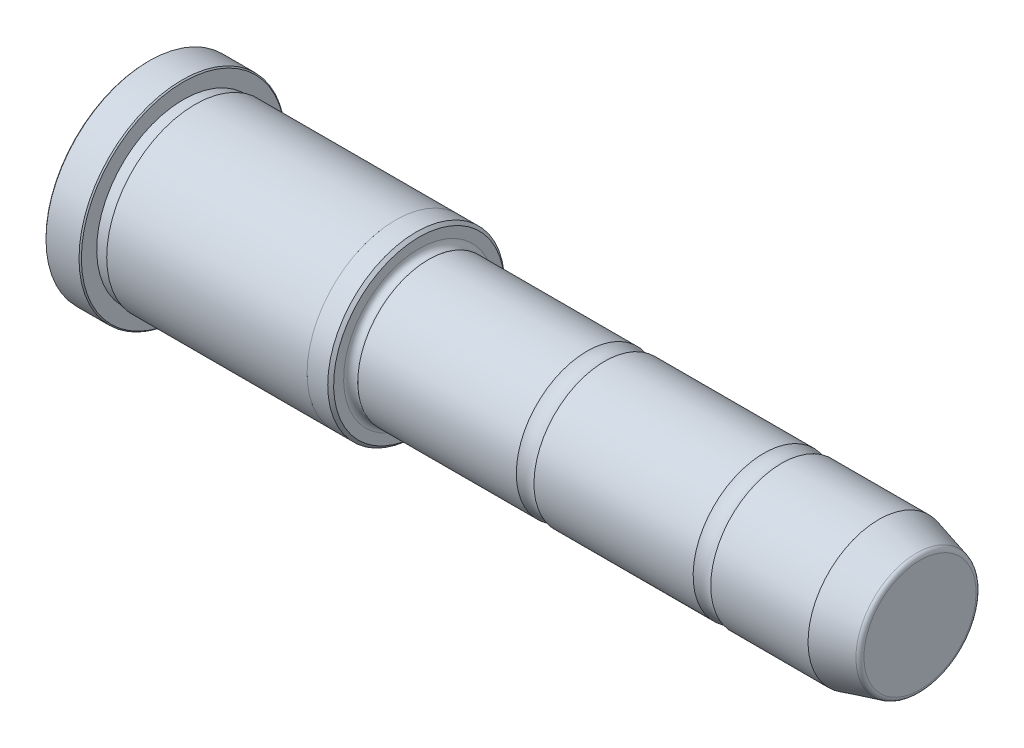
ISO-10303-21;
HEADER;
FILE_DESCRIPTION(('STEP AP214'),'2;1');
FILE_NAME('part.step','',(''),(''),'','','');
FILE_SCHEMA(('AUTOMOTIVE_DESIGN { 1 0 10303 214 1 1 1 1 }'));
ENDSEC;
DATA;
#1=APPLICATION_CONTEXT('core data for automotive mechanical design processes');
#2=APPLICATION_PROTOCOL_DEFINITION('international standard','automotive_design',2000,#1);
#3=PRODUCT_CONTEXT('',#1,'mechanical');
#4=PRODUCT('Part','Part','',(#3));
#5=PRODUCT_RELATED_PRODUCT_CATEGORY('part','',(#4));
#6=PRODUCT_DEFINITION_FORMATION('','',#4);
#7=PRODUCT_DEFINITION_CONTEXT('part definition',#1,'design');
#8=PRODUCT_DEFINITION('design','',#6,#7);
#9=PRODUCT_DEFINITION_SHAPE('','',#8);
#10=(LENGTH_UNIT() NAMED_UNIT(*) SI_UNIT(.MILLI.,.METRE.));
#11=(NAMED_UNIT(*) PLANE_ANGLE_UNIT() SI_UNIT($,.RADIAN.));
#12=(NAMED_UNIT(*) SI_UNIT($,.STERADIAN.) SOLID_ANGLE_UNIT());
#13=UNCERTAINTY_MEASURE_WITH_UNIT(LENGTH_MEASURE(1.E-05),#10,'distance_accuracy_value','');
#14=(GEOMETRIC_REPRESENTATION_CONTEXT(3) GLOBAL_UNCERTAINTY_ASSIGNED_CONTEXT((#13)) GLOBAL_UNIT_ASSIGNED_CONTEXT((#10,
#11,#12)) REPRESENTATION_CONTEXT('',''));
#15=CARTESIAN_POINT('',(0.,0.,0.));
#16=DIRECTION('',(0.,0.,1.));
#17=DIRECTION('',(1.,0.,0.));
#18=AXIS2_PLACEMENT_3D('',#15,#16,#17);
#19=CARTESIAN_POINT('',(85.,0.,0.));
#20=DIRECTION('',(1.,0.,0.));
#21=DIRECTION('',(0.,1.,0.));
#22=AXIS2_PLACEMENT_3D('',#19,#20,#21);
#23=CYLINDRICAL_SURFACE('',#22,12.);
#24=CARTESIAN_POINT('',(1.6,0.,0.));
#25=DIRECTION('',(1.,0.,0.));
#26=DIRECTION('',(0.,1.,0.));
#27=AXIS2_PLACEMENT_3D('',#24,#25,#26);
#28=CIRCLE('',#27,12.);
#29=CARTESIAN_POINT('',(1.6,12.,0.));
#30=VERTEX_POINT('',#29);
#31=EDGE_CURVE('E63',#30,#30,#28,.T.);
#32=ORIENTED_EDGE('',*,*,#31,.T.);
#33=EDGE_LOOP('',(#32));
#34=FACE_BOUND('',#33,.T.);
#35=CARTESIAN_POINT('',(28.5033370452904,0.,0.));
#36=DIRECTION('',(-1.,0.,0.));
#37=DIRECTION('',(0.,-1.,0.));
#38=AXIS2_PLACEMENT_3D('',#35,#36,#37);
#39=CIRCLE('',#38,12.);
#40=CARTESIAN_POINT('',(28.5033370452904,-12.,0.));
#41=VERTEX_POINT('',#40);
#42=EDGE_CURVE('E93',#41,#41,#39,.T.);
#43=ORIENTED_EDGE('',*,*,#42,.T.);
#44=EDGE_LOOP('',(#43));
#45=FACE_BOUND('',#44,.T.);
#46=ADVANCED_FACE('F28',(#34,#45),#23,.T.);
#47=CARTESIAN_POINT('',(1.,0.,0.));
#48=DIRECTION('',(1.,0.,0.));
#49=DIRECTION('',(0.,1.,0.));
#50=AXIS2_PLACEMENT_3D('',#47,#48,#49);
#51=TOROIDAL_SURFACE('',#50,12.8,1.);
#52=CARTESIAN_POINT('',(0.,0.,0.));
#53=DIRECTION('',(1.,0.,0.));
#54=DIRECTION('',(0.,1.,0.));
#55=AXIS2_PLACEMENT_3D('',#52,#53,#54);
#56=CIRCLE('',#55,12.8);
#57=CARTESIAN_POINT('',(0.,12.8,0.));
#58=VERTEX_POINT('',#57);
#59=EDGE_CURVE('E66',#58,#58,#56,.T.);
#60=ORIENTED_EDGE('',*,*,#59,.T.);
#61=EDGE_LOOP('',(#60));
#62=FACE_BOUND('',#61,.T.);
#63=ORIENTED_EDGE('',*,*,#31,.F.);
#64=EDGE_LOOP('',(#63));
#65=FACE_BOUND('',#64,.T.);
#66=ADVANCED_FACE('F116',(#62,#65),#51,.F.);
#67=CARTESIAN_POINT('',(0.,12.8,0.));
#68=DIRECTION('',(1.,0.,0.));
#69=DIRECTION('',(0.,1.,0.));
#70=AXIS2_PLACEMENT_3D('',#67,#68,#69);
#71=PLANE('',#70);
#72=CARTESIAN_POINT('',(0.,0.,0.));
#73=DIRECTION('',(1.,0.,0.));
#74=DIRECTION('',(0.,1.,0.));
#75=AXIS2_PLACEMENT_3D('',#72,#73,#74);
#76=CIRCLE('',#75,14.5);
#77=CARTESIAN_POINT('',(0.,14.5,0.));
#78=VERTEX_POINT('',#77);
#79=EDGE_CURVE('E35',#78,#78,#76,.T.);
#80=ORIENTED_EDGE('',*,*,#79,.T.);
#81=EDGE_LOOP('',(#80));
#82=FACE_BOUND('',#81,.T.);
#83=ORIENTED_EDGE('',*,*,#59,.F.);
#84=EDGE_LOOP('',(#83));
#85=FACE_BOUND('',#84,.T.);
#86=ADVANCED_FACE('F124',(#82,#85),#71,.T.);
#87=CARTESIAN_POINT('',(85.,0.,0.));
#88=DIRECTION('',(1.,0.,0.));
#89=DIRECTION('',(0.,1.,0.));
#90=AXIS2_PLACEMENT_3D('',#87,#88,#89);
#91=CYLINDRICAL_SURFACE('',#90,15.);
#92=CARTESIAN_POINT('',(-0.499999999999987,0.,0.));
#93=DIRECTION('',(1.,0.,0.));
#94=DIRECTION('',(0.,1.,0.));
#95=AXIS2_PLACEMENT_3D('',#92,#93,#94);
#96=CIRCLE('',#95,15.);
#97=CARTESIAN_POINT('',(-0.499999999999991,15.,0.));
#98=VERTEX_POINT('',#97);
#99=EDGE_CURVE('E10',#98,#98,#96,.F.);
#100=ORIENTED_EDGE('',*,*,#99,.T.);
#101=EDGE_LOOP('',(#100));
#102=FACE_BOUND('',#101,.T.);
#103=CARTESIAN_POINT('',(-4.,0.,0.));
#104=DIRECTION('',(1.,0.,0.));
#105=DIRECTION('',(0.,1.,0.));
#106=AXIS2_PLACEMENT_3D('',#103,#104,#105);
#107=CIRCLE('',#106,15.);
#108=CARTESIAN_POINT('',(-4.00000000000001,15.,0.));
#109=VERTEX_POINT('',#108);
#110=EDGE_CURVE('E69',#109,#109,#107,.T.);
#111=ORIENTED_EDGE('',*,*,#110,.T.);
#112=EDGE_LOOP('',(#111));
#113=FACE_BOUND('',#112,.T.);
#114=ADVANCED_FACE('F195',(#102,#113),#91,.T.);
#115=CARTESIAN_POINT('',(-4.,15.001,0.));
#116=DIRECTION('',(1.,0.,0.));
#117=DIRECTION('',(0.,1.,0.));
#118=AXIS2_PLACEMENT_3D('',#115,#116,#117);
#119=PLANE('',#118);
#120=CARTESIAN_POINT('',(-4.,0.,0.));
#121=DIRECTION('',(1.,0.,0.));
#122=DIRECTION('',(0.,1.,0.));
#123=AXIS2_PLACEMENT_3D('',#120,#121,#122);
#124=CIRCLE('',#123,15.001);
#125=CARTESIAN_POINT('',(-4.00000000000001,15.001,0.));
#126=VERTEX_POINT('',#125);
#127=EDGE_CURVE('E72',#126,#126,#124,.T.);
#128=ORIENTED_EDGE('',*,*,#127,.T.);
#129=EDGE_LOOP('',(#128));
#130=FACE_BOUND('',#129,.T.);
#131=ORIENTED_EDGE('',*,*,#110,.F.);
#132=EDGE_LOOP('',(#131));
#133=FACE_BOUND('',#132,.T.);
#134=ADVANCED_FACE('F189',(#130,#133),#119,.T.);
#135=CARTESIAN_POINT('',(85.,0.,0.));
#136=DIRECTION('',(1.,0.,0.));
#137=DIRECTION('',(0.,1.,0.));
#138=AXIS2_PLACEMENT_3D('',#135,#136,#137);
#139=CYLINDRICAL_SURFACE('',#138,15.001);
#140=CARTESIAN_POINT('',(-38.,0.,0.));
#141=DIRECTION('',(1.,0.,0.));
#142=DIRECTION('',(0.,1.,0.));
#143=AXIS2_PLACEMENT_3D('',#140,#141,#142);
#144=CIRCLE('',#143,15.001);
#145=CARTESIAN_POINT('',(-38.,15.001,0.));
#146=VERTEX_POINT('',#145);
#147=EDGE_CURVE('E75',#146,#146,#144,.T.);
#148=ORIENTED_EDGE('',*,*,#147,.T.);
#149=EDGE_LOOP('',(#148));
#150=FACE_BOUND('',#149,.T.);
#151=ORIENTED_EDGE('',*,*,#127,.F.);
#152=EDGE_LOOP('',(#151));
#153=FACE_BOUND('',#152,.T.);
#154=ADVANCED_FACE('F183',(#150,#153),#139,.T.);
#155=CARTESIAN_POINT('',(-38.,15.001,0.));
#156=DIRECTION('',(-1.,0.,0.));
#157=DIRECTION('',(0.,-1.,0.));
#158=AXIS2_PLACEMENT_3D('',#155,#156,#157);
#159=PLANE('',#158);
#160=CARTESIAN_POINT('',(-38.,0.,0.));
#161=DIRECTION('',(1.,0.,0.));
#162=DIRECTION('',(0.,1.,0.));
#163=AXIS2_PLACEMENT_3D('',#160,#161,#162);
#164=CIRCLE('',#163,14.7);
#165=CARTESIAN_POINT('',(-38.,14.7,0.));
#166=VERTEX_POINT('',#165);
#167=EDGE_CURVE('E78',#166,#166,#164,.T.);
#168=ORIENTED_EDGE('',*,*,#167,.T.);
#169=EDGE_LOOP('',(#168));
#170=FACE_BOUND('',#169,.T.);
#171=ORIENTED_EDGE('',*,*,#147,.F.);
#172=EDGE_LOOP('',(#171));
#173=FACE_BOUND('',#172,.T.);
#174=ADVANCED_FACE('F177',(#170,#173),#159,.T.);
#175=CARTESIAN_POINT('',(85.,0.,0.));
#176=DIRECTION('',(1.,0.,0.));
#177=DIRECTION('',(0.,1.,0.));
#178=AXIS2_PLACEMENT_3D('',#175,#176,#177);
#179=CYLINDRICAL_SURFACE('',#178,14.7);
#180=CARTESIAN_POINT('',(-40.,0.,0.));
#181=DIRECTION('',(1.,0.,0.));
#182=DIRECTION('',(0.,1.,0.));
#183=AXIS2_PLACEMENT_3D('',#180,#181,#182);
#184=CIRCLE('',#183,14.7);
#185=CARTESIAN_POINT('',(-40.,14.7,0.));
#186=VERTEX_POINT('',#185);
#187=EDGE_CURVE('E81',#186,#186,#184,.T.);
#188=ORIENTED_EDGE('',*,*,#187,.T.);
#189=EDGE_LOOP('',(#188));
#190=FACE_BOUND('',#189,.T.);
#191=ORIENTED_EDGE('',*,*,#167,.F.);
#192=EDGE_LOOP('',(#191));
#193=FACE_BOUND('',#192,.T.);
#194=ADVANCED_FACE('F171',(#190,#193),#179,.T.);
#195=CARTESIAN_POINT('',(-40.,14.7,0.));
#196=DIRECTION('',(1.,0.,0.));
#197=DIRECTION('',(0.,1.,0.));
#198=AXIS2_PLACEMENT_3D('',#195,#196,#197);
#199=PLANE('',#198);
#200=CARTESIAN_POINT('',(-40.,0.,0.));
#201=DIRECTION('',(1.,0.,0.));
#202=DIRECTION('',(0.,1.,0.));
#203=AXIS2_PLACEMENT_3D('',#200,#201,#202);
#204=CIRCLE('',#203,17.3);
#205=CARTESIAN_POINT('',(-40.,17.3,0.));
#206=VERTEX_POINT('',#205);
#207=EDGE_CURVE('E39',#206,#206,#204,.T.);
#208=ORIENTED_EDGE('',*,*,#207,.T.);
#209=EDGE_LOOP('',(#208));
#210=FACE_BOUND('',#209,.T.);
#211=ORIENTED_EDGE('',*,*,#187,.F.);
#212=EDGE_LOOP('',(#211));
#213=FACE_BOUND('',#212,.T.);
#214=ADVANCED_FACE('F168',(#210,#213),#199,.T.);
#215=CARTESIAN_POINT('',(85.,0.,0.));
#216=DIRECTION('',(1.,0.,0.));
#217=DIRECTION('',(0.,1.,0.));
#218=AXIS2_PLACEMENT_3D('',#215,#216,#217);
#219=CYLINDRICAL_SURFACE('',#218,17.5);
#220=CARTESIAN_POINT('',(-45.8,0.,0.));
#221=DIRECTION('',(-1.,0.,0.));
#222=DIRECTION('',(0.,-1.,0.));
#223=AXIS2_PLACEMENT_3D('',#220,#221,#222);
#224=CIRCLE('',#223,17.5);
#225=CARTESIAN_POINT('',(-45.8,17.5,0.));
#226=VERTEX_POINT('',#225);
#227=EDGE_CURVE('E48',#226,#226,#224,.F.);
#228=ORIENTED_EDGE('',*,*,#227,.T.);
#229=EDGE_LOOP('',(#228));
#230=FACE_BOUND('',#229,.T.);
#231=CARTESIAN_POINT('',(-40.2,0.,0.));
#232=DIRECTION('',(1.,0.,0.));
#233=DIRECTION('',(0.,1.,0.));
#234=AXIS2_PLACEMENT_3D('',#231,#232,#233);
#235=CIRCLE('',#234,17.5);
#236=CARTESIAN_POINT('',(-40.2,17.5,0.));
#237=VERTEX_POINT('',#236);
#238=EDGE_CURVE('E51',#237,#237,#235,.F.);
#239=ORIENTED_EDGE('',*,*,#238,.T.);
#240=EDGE_LOOP('',(#239));
#241=FACE_BOUND('',#240,.T.);
#242=ADVANCED_FACE('F111',(#230,#241),#219,.T.);
#243=CARTESIAN_POINT('',(-46.,17.5,0.));
#244=DIRECTION('',(-1.,0.,0.));
#245=DIRECTION('',(0.,-1.,0.));
#246=AXIS2_PLACEMENT_3D('',#243,#244,#245);
#247=PLANE('',#246);
#248=CARTESIAN_POINT('',(-46.,0.,0.));
#249=DIRECTION('',(-1.,0.,0.));
#250=DIRECTION('',(0.,-1.,0.));
#251=AXIS2_PLACEMENT_3D('',#248,#249,#250);
#252=CIRCLE('',#251,17.3);
#253=CARTESIAN_POINT('',(-46.,17.3,0.));
#254=VERTEX_POINT('',#253);
#255=EDGE_CURVE('E43',#254,#254,#252,.T.);
#256=ORIENTED_EDGE('',*,*,#255,.T.);
#257=EDGE_LOOP('',(#256));
#258=FACE_BOUND('',#257,.T.);
#259=ADVANCED_FACE('F101',(#258),#247,.T.);
#260=CARTESIAN_POINT('',(30.,0.,0.));
#261=DIRECTION('',(-1.,0.,0.));
#262=DIRECTION('',(0.,-1.,0.));
#263=AXIS2_PLACEMENT_3D('',#260,#261,#262);
#264=TOROIDAL_SURFACE('',#263,14.6,3.);
#265=CARTESIAN_POINT('',(31.4966629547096,0.,0.));
#266=DIRECTION('',(-1.,0.,0.));
#267=DIRECTION('',(0.,-1.,0.));
#268=AXIS2_PLACEMENT_3D('',#265,#266,#267);
#269=CIRCLE('',#268,12.);
#270=CARTESIAN_POINT('',(31.4966629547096,-12.,0.));
#271=VERTEX_POINT('',#270);
#272=EDGE_CURVE('E90',#271,#271,#269,.T.);
#273=ORIENTED_EDGE('',*,*,#272,.T.);
#274=EDGE_LOOP('',(#273));
#275=FACE_BOUND('',#274,.T.);
#276=ORIENTED_EDGE('',*,*,#42,.F.);
#277=EDGE_LOOP('',(#276));
#278=FACE_BOUND('',#277,.T.);
#279=ADVANCED_FACE('F98',(#275,#278),#264,.F.);
#280=CARTESIAN_POINT('',(85.,10.1243556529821,0.));
#281=DIRECTION('',(1.,0.,0.));
#282=DIRECTION('',(0.,1.,0.));
#283=AXIS2_PLACEMENT_3D('',#280,#281,#282);
#284=PLANE('',#283);
#285=CARTESIAN_POINT('',(85.,0.,0.));
#286=DIRECTION('',(1.,0.,0.));
#287=DIRECTION('',(0.,1.,0.));
#288=AXIS2_PLACEMENT_3D('',#285,#286,#287);
#289=CIRCLE('',#288,9.51049406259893);
#290=CARTESIAN_POINT('',(85.,9.51049406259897,0.));
#291=VERTEX_POINT('',#290);
#292=EDGE_CURVE('E57',#291,#291,#289,.T.);
#293=ORIENTED_EDGE('',*,*,#292,.T.);
#294=EDGE_LOOP('',(#293));
#295=FACE_BOUND('',#294,.T.);
#296=ADVANCED_FACE('F100',(#295),#284,.T.);
#297=CARTESIAN_POINT('',(85.,0.,0.));
#298=DIRECTION('',(-1.,0.,0.));
#299=DIRECTION('',(0.,-1.,0.));
#300=AXIS2_PLACEMENT_3D('',#297,#298,#299);
#301=CONICAL_SURFACE('',#300,10.1243556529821,0.26179938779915);
#302=CARTESIAN_POINT('',(84.407055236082,0.,0.));
#303=DIRECTION('',(1.,0.,0.));
#304=DIRECTION('',(0.,1.,0.));
#305=AXIS2_PLACEMENT_3D('',#302,#303,#304);
#306=CIRCLE('',#305,10.2832347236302);
#307=CARTESIAN_POINT('',(84.407055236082,10.2832347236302,0.));
#308=VERTEX_POINT('',#307);
#309=EDGE_CURVE('E54',#308,#308,#306,.F.);
#310=ORIENTED_EDGE('',*,*,#309,.T.);
#311=EDGE_LOOP('',(#310));
#312=FACE_BOUND('',#311,.T.);
#313=CARTESIAN_POINT('',(78.,0.,0.));
#314=DIRECTION('',(1.,0.,0.));
#315=DIRECTION('',(0.,1.,0.));
#316=AXIS2_PLACEMENT_3D('',#313,#314,#315);
#317=CIRCLE('',#316,12.);
#318=CARTESIAN_POINT('',(78.,12.,0.));
#319=VERTEX_POINT('',#318);
#320=EDGE_CURVE('E60',#319,#319,#317,.T.);
#321=ORIENTED_EDGE('',*,*,#320,.T.);
#322=EDGE_LOOP('',(#321));
#323=FACE_BOUND('',#322,.T.);
#324=ADVANCED_FACE('F108',(#312,#323),#301,.T.);
#325=ORIENTED_EDGE('',*,*,#320,.F.);
#326=EDGE_LOOP('',(#325));
#327=FACE_BOUND('',#326,.T.);
#328=CARTESIAN_POINT('',(61.4966629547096,0.,0.));
#329=DIRECTION('',(-1.,0.,0.));
#330=DIRECTION('',(0.,-1.,0.));
#331=AXIS2_PLACEMENT_3D('',#328,#329,#330);
#332=CIRCLE('',#331,12.);
#333=CARTESIAN_POINT('',(61.4966629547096,-12.,0.));
#334=VERTEX_POINT('',#333);
#335=EDGE_CURVE('E84',#334,#334,#332,.T.);
#336=ORIENTED_EDGE('',*,*,#335,.F.);
#337=EDGE_LOOP('',(#336));
#338=FACE_BOUND('',#337,.T.);
#339=ADVANCED_FACE('F120',(#327,#338),#23,.T.);
#340=CARTESIAN_POINT('',(60.,0.,0.));
#341=DIRECTION('',(-1.,0.,0.));
#342=DIRECTION('',(0.,-1.,0.));
#343=AXIS2_PLACEMENT_3D('',#340,#341,#342);
#344=TOROIDAL_SURFACE('',#343,14.6,3.);
#345=ORIENTED_EDGE('',*,*,#335,.T.);
#346=EDGE_LOOP('',(#345));
#347=FACE_BOUND('',#346,.T.);
#348=CARTESIAN_POINT('',(58.5033370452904,0.,0.));
#349=DIRECTION('',(-1.,0.,0.));
#350=DIRECTION('',(0.,-1.,0.));
#351=AXIS2_PLACEMENT_3D('',#348,#349,#350);
#352=CIRCLE('',#351,12.);
#353=CARTESIAN_POINT('',(58.5033370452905,-12.,0.));
#354=VERTEX_POINT('',#353);
#355=EDGE_CURVE('E87',#354,#354,#352,.T.);
#356=ORIENTED_EDGE('',*,*,#355,.F.);
#357=EDGE_LOOP('',(#356));
#358=FACE_BOUND('',#357,.T.);
#359=ADVANCED_FACE('F130',(#347,#358),#344,.F.);
#360=ORIENTED_EDGE('',*,*,#355,.T.);
#361=EDGE_LOOP('',(#360));
#362=FACE_BOUND('',#361,.T.);
#363=ORIENTED_EDGE('',*,*,#272,.F.);
#364=EDGE_LOOP('',(#363));
#365=FACE_BOUND('',#364,.T.);
#366=ADVANCED_FACE('F119',(#362,#365),#23,.T.);
#367=CARTESIAN_POINT('',(84.2,0.,0.));
#368=DIRECTION('',(1.,0.,0.));
#369=DIRECTION('',(0.,1.,0.));
#370=AXIS2_PLACEMENT_3D('',#367,#368,#369);
#371=TOROIDAL_SURFACE('',#370,9.51049406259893,0.8);
#372=ORIENTED_EDGE('',*,*,#309,.F.);
#373=EDGE_LOOP('',(#372));
#374=FACE_BOUND('',#373,.T.);
#375=ORIENTED_EDGE('',*,*,#292,.F.);
#376=EDGE_LOOP('',(#375));
#377=FACE_BOUND('',#376,.T.);
#378=ADVANCED_FACE('F129',(#374,#377),#371,.T.);
#379=CARTESIAN_POINT('',(-45.8,0.,0.));
#380=DIRECTION('',(1.,0.,0.));
#381=DIRECTION('',(0.,1.,0.));
#382=AXIS2_PLACEMENT_3D('',#379,#380,#381);
#383=CONICAL_SURFACE('',#382,17.5,0.785398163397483);
#384=CARTESIAN_POINT('',(-46.,17.3,0.));
#385=CARTESIAN_POINT('',(-45.9979166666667,17.3020833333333,0.));
#386=CARTESIAN_POINT('',(-45.9958333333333,17.3041666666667,0.));
#387=CARTESIAN_POINT('',(-45.9916666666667,17.3083333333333,0.));
#388=CARTESIAN_POINT('',(-45.9895833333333,17.3104166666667,0.));
#389=CARTESIAN_POINT('',(-45.9854166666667,17.3145833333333,0.));
#390=CARTESIAN_POINT('',(-45.9833333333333,17.3166666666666,0.));
#391=CARTESIAN_POINT('',(-45.9791666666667,17.3208333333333,0.));
#392=CARTESIAN_POINT('',(-45.9770833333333,17.3229166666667,0.));
#393=CARTESIAN_POINT('',(-45.9729166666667,17.3270833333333,0.));
#394=CARTESIAN_POINT('',(-45.9708333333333,17.3291666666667,0.));
#395=CARTESIAN_POINT('',(-45.9666666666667,17.3333333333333,0.));
#396=CARTESIAN_POINT('',(-45.9645833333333,17.3354166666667,0.));
#397=CARTESIAN_POINT('',(-45.9604166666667,17.3395833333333,0.));
#398=CARTESIAN_POINT('',(-45.9583333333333,17.3416666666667,0.));
#399=CARTESIAN_POINT('',(-45.9541666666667,17.3458333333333,0.));
#400=CARTESIAN_POINT('',(-45.9520833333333,17.3479166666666,0.));
#401=CARTESIAN_POINT('',(-45.9479166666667,17.3520833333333,0.));
#402=CARTESIAN_POINT('',(-45.9458333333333,17.3541666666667,0.));
#403=CARTESIAN_POINT('',(-45.9416666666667,17.3583333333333,0.));
#404=CARTESIAN_POINT('',(-45.9395833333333,17.3604166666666,0.));
#405=CARTESIAN_POINT('',(-45.9354166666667,17.3645833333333,0.));
#406=CARTESIAN_POINT('',(-45.9333333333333,17.3666666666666,0.));
#407=CARTESIAN_POINT('',(-45.9291666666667,17.3708333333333,0.));
#408=CARTESIAN_POINT('',(-45.9270833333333,17.3729166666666,0.));
#409=CARTESIAN_POINT('',(-45.9229166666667,17.3770833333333,0.));
#410=CARTESIAN_POINT('',(-45.9208333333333,17.3791666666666,0.));
#411=CARTESIAN_POINT('',(-45.9166666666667,17.3833333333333,0.));
#412=CARTESIAN_POINT('',(-45.9145833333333,17.3854166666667,0.));
#413=CARTESIAN_POINT('',(-45.9104166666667,17.3895833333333,0.));
#414=CARTESIAN_POINT('',(-45.9083333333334,17.3916666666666,0.));
#415=CARTESIAN_POINT('',(-45.9041666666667,17.3958333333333,0.));
#416=CARTESIAN_POINT('',(-45.9020833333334,17.3979166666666,0.));
#417=CARTESIAN_POINT('',(-45.8979166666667,17.4020833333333,0.));
#418=CARTESIAN_POINT('',(-45.8958333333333,17.4041666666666,0.));
#419=CARTESIAN_POINT('',(-45.8916666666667,17.4083333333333,0.));
#420=CARTESIAN_POINT('',(-45.8895833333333,17.4104166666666,0.));
#421=CARTESIAN_POINT('',(-45.8854166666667,17.4145833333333,0.));
#422=CARTESIAN_POINT('',(-45.8833333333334,17.4166666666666,0.));
#423=CARTESIAN_POINT('',(-45.8791666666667,17.4208333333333,0.));
#424=CARTESIAN_POINT('',(-45.8770833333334,17.4229166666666,0.));
#425=CARTESIAN_POINT('',(-45.8729166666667,17.4270833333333,0.));
#426=CARTESIAN_POINT('',(-45.8708333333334,17.4291666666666,0.));
#427=CARTESIAN_POINT('',(-45.8666666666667,17.4333333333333,0.));
#428=CARTESIAN_POINT('',(-45.8645833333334,17.4354166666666,0.));
#429=CARTESIAN_POINT('',(-45.8604166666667,17.4395833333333,0.));
#430=CARTESIAN_POINT('',(-45.8583333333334,17.4416666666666,0.));
#431=CARTESIAN_POINT('',(-45.8541666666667,17.4458333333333,0.));
#432=CARTESIAN_POINT('',(-45.8520833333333,17.4479166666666,0.));
#433=CARTESIAN_POINT('',(-45.8479166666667,17.4520833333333,0.));
#434=CARTESIAN_POINT('',(-45.8458333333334,17.4541666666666,0.));
#435=CARTESIAN_POINT('',(-45.8416666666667,17.4583333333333,0.));
#436=CARTESIAN_POINT('',(-45.8395833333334,17.4604166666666,0.));
#437=CARTESIAN_POINT('',(-45.8354166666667,17.4645833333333,0.));
#438=CARTESIAN_POINT('',(-45.8333333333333,17.4666666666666,0.));
#439=CARTESIAN_POINT('',(-45.8291666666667,17.4708333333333,0.));
#440=CARTESIAN_POINT('',(-45.8270833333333,17.4729166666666,0.));
#441=CARTESIAN_POINT('',(-45.8229166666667,17.4770833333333,0.));
#442=CARTESIAN_POINT('',(-45.8208333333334,17.4791666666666,0.));
#443=CARTESIAN_POINT('',(-45.8166666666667,17.4833333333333,0.));
#444=CARTESIAN_POINT('',(-45.8145833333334,17.4854166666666,0.));
#445=CARTESIAN_POINT('',(-45.8104166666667,17.4895833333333,0.));
#446=CARTESIAN_POINT('',(-45.8083333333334,17.4916666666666,0.));
#447=CARTESIAN_POINT('',(-45.8041666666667,17.4958333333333,0.));
#448=CARTESIAN_POINT('',(-45.8020833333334,17.4979166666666,0.));
#449=CARTESIAN_POINT('',(-45.8,17.5,0.));
#450=B_SPLINE_CURVE_WITH_KNOTS('',3,(#384,#385,#386,#387,#388,#389,#390,#391,#392,#393,#394,
#395,#396,#397,#398,#399,#400,#401,#402,#403,#404,#405,#406,#407,#408,#409,#410,#411,#412,#413,
#414,#415,#416,#417,#418,#419,#420,#421,#422,#423,#424,#425,#426,#427,#428,#429,#430,#431,#432,
#433,#434,#435,#436,#437,#438,#439,#440,#441,#442,#443,#444,#445,#446,#447,#448,#449),
.UNSPECIFIED.,.F.,.F.,(4,2,2,2,2,2,2,2,2,2,2,2,2,2,2,2,2,2,2,2,2,2,2,2,2,2,2,2,2,2,2,2,4),(0.,
0.00883883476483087,0.0176776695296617,0.0265165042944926,0.0353553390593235,0.0441941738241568,
0.0530330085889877,0.0618718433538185,0.0707106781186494,0.0795495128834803,0.0883883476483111,
0.097227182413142,0.106066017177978,0.114904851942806,0.123743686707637,0.132582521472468,
0.141421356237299,0.15026019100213,0.159099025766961,0.167937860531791,0.176776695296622,
0.185615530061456,0.194454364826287,0.203293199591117,0.212132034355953,0.220970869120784,
0.229809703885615,0.238648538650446,0.247487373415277,0.25632620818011,0.265165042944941,
0.274003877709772,0.282842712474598),.UNSPECIFIED.);
#451=EDGE_CURVE('BSEAM153',#254,#226,#450,.T.);
#452=ORIENTED_EDGE('',*,*,#255,.F.);
#453=ORIENTED_EDGE('',*,*,#227,.F.);
#454=ORIENTED_EDGE('',*,*,#451,.T.);
#455=ORIENTED_EDGE('',*,*,#451,.F.);
#456=EDGE_LOOP('',(#452,#454,#453,#455));
#457=FACE_BOUND('',#456,.T.);
#458=ADVANCED_FACE('F153',(#457),#383,.T.);
#459=CARTESIAN_POINT('',(-40.,0.,0.));
#460=DIRECTION('',(-1.,0.,0.));
#461=DIRECTION('',(0.,-1.,0.));
#462=AXIS2_PLACEMENT_3D('',#459,#460,#461);
#463=CONICAL_SURFACE('',#462,17.3,0.785398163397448);
#464=ORIENTED_EDGE('',*,*,#238,.F.);
#465=EDGE_LOOP('',(#464));
#466=FACE_BOUND('',#465,.T.);
#467=ORIENTED_EDGE('',*,*,#207,.F.);
#468=EDGE_LOOP('',(#467));
#469=FACE_BOUND('',#468,.T.);
#470=ADVANCED_FACE('F156',(#466,#469),#463,.T.);
#471=CARTESIAN_POINT('',(0.,0.,0.));
#472=DIRECTION('',(-1.,0.,0.));
#473=DIRECTION('',(0.,-1.,0.));
#474=AXIS2_PLACEMENT_3D('',#471,#472,#473);
#475=CONICAL_SURFACE('',#474,14.5,0.78539816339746);
#476=ORIENTED_EDGE('',*,*,#99,.F.);
#477=EDGE_LOOP('',(#476));
#478=FACE_BOUND('',#477,.T.);
#479=ORIENTED_EDGE('',*,*,#79,.F.);
#480=EDGE_LOOP('',(#479));
#481=FACE_BOUND('',#480,.T.);
#482=ADVANCED_FACE('F30',(#478,#481),#475,.T.);
#483=CLOSED_SHELL('',(#46,#66,#86,#114,#134,#154,#174,#194,#214,#242,#259,#279,#296,#324,#339,
#359,#366,#378,#458,#470,#482));
#484=MANIFOLD_SOLID_BREP('B2',#483);
#485=ADVANCED_BREP_SHAPE_REPRESENTATION('',(#18,#484),#14);
#486=SHAPE_DEFINITION_REPRESENTATION(#9,#485);
ENDSEC;
END-ISO-10303-21;
